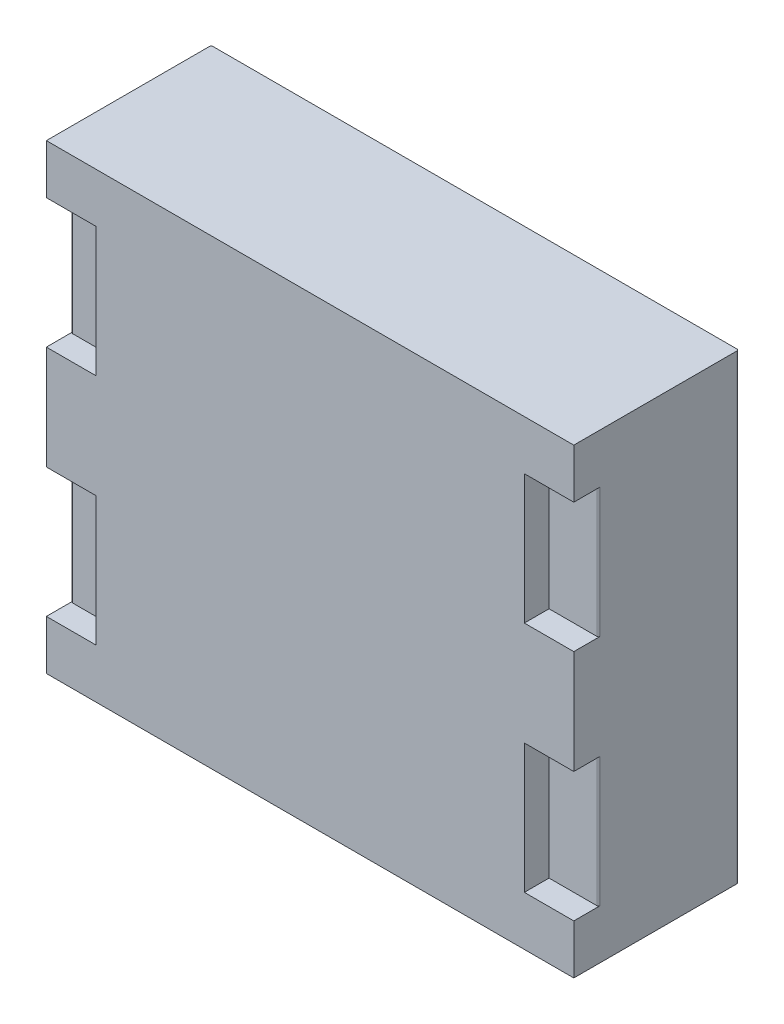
ISO-10303-21;
HEADER;
FILE_DESCRIPTION(('STEP AP214'),'2;1');
FILE_NAME('part.step','',(''),(''),'','','');
FILE_SCHEMA(('AUTOMOTIVE_DESIGN { 1 0 10303 214 1 1 1 1 }'));
ENDSEC;
DATA;
#1=APPLICATION_CONTEXT('core data for automotive mechanical design processes');
#2=APPLICATION_PROTOCOL_DEFINITION('international standard','automotive_design',2000,#1);
#3=PRODUCT_CONTEXT('',#1,'mechanical');
#4=PRODUCT('Part','Part','',(#3));
#5=PRODUCT_RELATED_PRODUCT_CATEGORY('part','',(#4));
#6=PRODUCT_DEFINITION_FORMATION('','',#4);
#7=PRODUCT_DEFINITION_CONTEXT('part definition',#1,'design');
#8=PRODUCT_DEFINITION('design','',#6,#7);
#9=PRODUCT_DEFINITION_SHAPE('','',#8);
#10=(LENGTH_UNIT() NAMED_UNIT(*) SI_UNIT(.MILLI.,.METRE.));
#11=(NAMED_UNIT(*) PLANE_ANGLE_UNIT() SI_UNIT($,.RADIAN.));
#12=(NAMED_UNIT(*) SI_UNIT($,.STERADIAN.) SOLID_ANGLE_UNIT());
#13=UNCERTAINTY_MEASURE_WITH_UNIT(LENGTH_MEASURE(1.E-05),#10,'distance_accuracy_value','');
#14=(GEOMETRIC_REPRESENTATION_CONTEXT(3) GLOBAL_UNCERTAINTY_ASSIGNED_CONTEXT((#13)) GLOBAL_UNIT_ASSIGNED_CONTEXT((#10,
#11,#12)) REPRESENTATION_CONTEXT('',''));
#15=CARTESIAN_POINT('',(0.,0.,0.));
#16=DIRECTION('',(0.,0.,1.));
#17=DIRECTION('',(1.,0.,0.));
#18=AXIS2_PLACEMENT_3D('',#15,#16,#17);
#19=CARTESIAN_POINT('',(-1.3,-0.315,1.));
#20=DIRECTION('',(0.,1.,0.));
#21=DIRECTION('',(1.,0.,0.));
#22=AXIS2_PLACEMENT_3D('',#19,#20,#21);
#23=PLANE('',#22);
#24=DIRECTION('',(0.,0.,-1.));
#25=VECTOR('',#24,1.);
#26=CARTESIAN_POINT('',(-1.6,-0.315,1.));
#27=LINE('',#26,#25);
#28=CARTESIAN_POINT('',(-1.6,-0.315,1.));
#29=VERTEX_POINT('',#28);
#30=CARTESIAN_POINT('',(-1.6,-0.315,0.84));
#31=VERTEX_POINT('',#30);
#32=EDGE_CURVE('E354',#29,#31,#27,.T.);
#33=ORIENTED_EDGE('',*,*,#32,.T.);
#34=CARTESIAN_POINT('',(-1.59,-0.315,0.84));
#35=DIRECTION('',(0.,1.,0.));
#36=DIRECTION('',(0.,0.,1.));
#37=AXIS2_PLACEMENT_3D('',#34,#35,#36);
#38=CIRCLE('',#37,0.01);
#39=CARTESIAN_POINT('',(-1.59,-0.315,0.85));
#40=VERTEX_POINT('',#39);
#41=EDGE_CURVE('E98',#31,#40,#38,.T.);
#42=ORIENTED_EDGE('',*,*,#41,.T.);
#43=DIRECTION('',(-1.,0.,0.));
#44=VECTOR('',#43,1.);
#45=CARTESIAN_POINT('',(-1.3,-0.315,0.85));
#46=LINE('',#45,#44);
#47=CARTESIAN_POINT('',(-1.3,-0.315,0.85));
#48=VERTEX_POINT('',#47);
#49=EDGE_CURVE('E265',#48,#40,#46,.T.);
#50=ORIENTED_EDGE('',*,*,#49,.F.);
#51=DIRECTION('',(0.,0.,-1.));
#52=VECTOR('',#51,1.);
#53=CARTESIAN_POINT('',(-1.3,-0.315,1.));
#54=LINE('',#53,#52);
#55=CARTESIAN_POINT('',(-1.3,-0.315,1.));
#56=VERTEX_POINT('',#55);
#57=EDGE_CURVE('E217',#56,#48,#54,.T.);
#58=ORIENTED_EDGE('',*,*,#57,.F.);
#59=DIRECTION('',(-1.,0.,0.));
#60=VECTOR('',#59,1.);
#61=CARTESIAN_POINT('',(-1.3,-0.315,1.));
#62=LINE('',#61,#60);
#63=EDGE_CURVE('E216',#56,#29,#62,.T.);
#64=ORIENTED_EDGE('',*,*,#63,.T.);
#65=EDGE_LOOP('',(#33,#42,#50,#58,#64));
#66=FACE_BOUND('',#65,.T.);
#67=ADVANCED_FACE('F17',(#66),#23,.F.);
#68=CARTESIAN_POINT('',(1.3,-1.1,0.85));
#69=DIRECTION('',(0.,0.,-1.));
#70=DIRECTION('',(0.,-1.,0.));
#71=AXIS2_PLACEMENT_3D('',#68,#69,#70);
#72=PLANE('',#71);
#73=DIRECTION('',(1.,0.,0.));
#74=VECTOR('',#73,1.);
#75=CARTESIAN_POINT('',(1.3,-1.1,0.85));
#76=LINE('',#75,#74);
#77=CARTESIAN_POINT('',(1.3,-1.1,0.85));
#78=VERTEX_POINT('',#77);
#79=CARTESIAN_POINT('',(1.59,-1.1,0.85));
#80=VERTEX_POINT('',#79);
#81=EDGE_CURVE('E122',#78,#80,#76,.T.);
#82=ORIENTED_EDGE('',*,*,#81,.T.);
#83=DIRECTION('',(0.,1.,0.));
#84=VECTOR('',#83,1.);
#85=CARTESIAN_POINT('',(1.59,-1.1,0.85));
#86=LINE('',#85,#84);
#87=CARTESIAN_POINT('',(1.59,-0.315,0.85));
#88=VERTEX_POINT('',#87);
#89=EDGE_CURVE('E304',#80,#88,#86,.T.);
#90=ORIENTED_EDGE('',*,*,#89,.T.);
#91=DIRECTION('',(1.,0.,0.));
#92=VECTOR('',#91,1.);
#93=CARTESIAN_POINT('',(1.3,-0.315,0.85));
#94=LINE('',#93,#92);
#95=CARTESIAN_POINT('',(1.3,-0.315,0.85));
#96=VERTEX_POINT('',#95);
#97=EDGE_CURVE('E11',#96,#88,#94,.T.);
#98=ORIENTED_EDGE('',*,*,#97,.F.);
#99=DIRECTION('',(0.,1.,0.));
#100=VECTOR('',#99,1.);
#101=CARTESIAN_POINT('',(1.3,-1.1,0.85));
#102=LINE('',#101,#100);
#103=EDGE_CURVE('E45',#78,#96,#102,.T.);
#104=ORIENTED_EDGE('',*,*,#103,.F.);
#105=EDGE_LOOP('',(#82,#90,#98,#104));
#106=FACE_BOUND('',#105,.T.);
#107=ADVANCED_FACE('F408',(#106),#72,.F.);
#108=CARTESIAN_POINT('',(1.3,-0.315,0.85));
#109=DIRECTION('',(0.,1.,0.));
#110=DIRECTION('',(1.,0.,0.));
#111=AXIS2_PLACEMENT_3D('',#108,#109,#110);
#112=PLANE('',#111);
#113=DIRECTION('',(0.,0.,1.));
#114=VECTOR('',#113,1.);
#115=CARTESIAN_POINT('',(1.6,-0.315,0.85));
#116=LINE('',#115,#114);
#117=CARTESIAN_POINT('',(1.6,-0.315,0.84));
#118=VERTEX_POINT('',#117);
#119=CARTESIAN_POINT('',(1.6,-0.315,1.));
#120=VERTEX_POINT('',#119);
#121=EDGE_CURVE('E168',#118,#120,#116,.T.);
#122=ORIENTED_EDGE('',*,*,#121,.T.);
#123=DIRECTION('',(1.,0.,0.));
#124=VECTOR('',#123,1.);
#125=CARTESIAN_POINT('',(1.3,-0.315,1.));
#126=LINE('',#125,#124);
#127=CARTESIAN_POINT('',(1.3,-0.315,1.));
#128=VERTEX_POINT('',#127);
#129=EDGE_CURVE('E110',#128,#120,#126,.T.);
#130=ORIENTED_EDGE('',*,*,#129,.F.);
#131=DIRECTION('',(0.,0.,1.));
#132=VECTOR('',#131,1.);
#133=CARTESIAN_POINT('',(1.3,-0.315,0.85));
#134=LINE('',#133,#132);
#135=EDGE_CURVE('E25',#96,#128,#134,.T.);
#136=ORIENTED_EDGE('',*,*,#135,.F.);
#137=ORIENTED_EDGE('',*,*,#97,.T.);
#138=CARTESIAN_POINT('',(1.59,-0.315,0.84));
#139=DIRECTION('',(0.,1.,0.));
#140=DIRECTION('',(0.,0.,1.));
#141=AXIS2_PLACEMENT_3D('',#138,#139,#140);
#142=CIRCLE('',#141,0.01);
#143=EDGE_CURVE('E371',#88,#118,#142,.T.);
#144=ORIENTED_EDGE('',*,*,#143,.T.);
#145=EDGE_LOOP('',(#122,#130,#136,#137,#144));
#146=FACE_BOUND('',#145,.T.);
#147=ADVANCED_FACE('F418',(#146),#112,.F.);
#148=CARTESIAN_POINT('',(1.3,-1.1,0.85));
#149=DIRECTION('',(1.,0.,0.));
#150=DIRECTION('',(0.,-1.,0.));
#151=AXIS2_PLACEMENT_3D('',#148,#149,#150);
#152=PLANE('',#151);
#153=DIRECTION('',(0.,0.,-1.));
#154=VECTOR('',#153,1.);
#155=CARTESIAN_POINT('',(1.3,-1.1,1.));
#156=LINE('',#155,#154);
#157=CARTESIAN_POINT('',(1.3,-1.1,1.));
#158=VERTEX_POINT('',#157);
#159=EDGE_CURVE('E125',#158,#78,#156,.T.);
#160=ORIENTED_EDGE('',*,*,#159,.T.);
#161=ORIENTED_EDGE('',*,*,#103,.T.);
#162=ORIENTED_EDGE('',*,*,#135,.T.);
#163=DIRECTION('',(0.,-1.,0.));
#164=VECTOR('',#163,1.);
#165=CARTESIAN_POINT('',(1.3,-0.315,1.));
#166=LINE('',#165,#164);
#167=EDGE_CURVE('E162',#128,#158,#166,.T.);
#168=ORIENTED_EDGE('',*,*,#167,.T.);
#169=EDGE_LOOP('',(#160,#161,#162,#168));
#170=FACE_BOUND('',#169,.T.);
#171=ADVANCED_FACE('F400',(#170),#152,.T.);
#172=CARTESIAN_POINT('',(1.3,-1.1,1.));
#173=DIRECTION('',(0.,-1.,0.));
#174=DIRECTION('',(0.,0.,-1.));
#175=AXIS2_PLACEMENT_3D('',#172,#173,#174);
#176=PLANE('',#175);
#177=DIRECTION('',(0.,0.,-1.));
#178=VECTOR('',#177,1.);
#179=CARTESIAN_POINT('',(1.6,-1.1,1.));
#180=LINE('',#179,#178);
#181=CARTESIAN_POINT('',(1.6,-1.1,1.));
#182=VERTEX_POINT('',#181);
#183=CARTESIAN_POINT('',(1.6,-1.1,0.84));
#184=VERTEX_POINT('',#183);
#185=EDGE_CURVE('E167',#182,#184,#180,.T.);
#186=ORIENTED_EDGE('',*,*,#185,.T.);
#187=CARTESIAN_POINT('',(1.59,-1.1,0.84));
#188=DIRECTION('',(0.,-1.,0.));
#189=DIRECTION('',(0.,0.,-1.));
#190=AXIS2_PLACEMENT_3D('',#187,#188,#189);
#191=CIRCLE('',#190,0.01);
#192=EDGE_CURVE('E375',#184,#80,#191,.T.);
#193=ORIENTED_EDGE('',*,*,#192,.T.);
#194=ORIENTED_EDGE('',*,*,#81,.F.);
#195=ORIENTED_EDGE('',*,*,#159,.F.);
#196=DIRECTION('',(1.,0.,0.));
#197=VECTOR('',#196,1.);
#198=CARTESIAN_POINT('',(1.3,-1.1,1.));
#199=LINE('',#198,#197);
#200=EDGE_CURVE('E154',#158,#182,#199,.T.);
#201=ORIENTED_EDGE('',*,*,#200,.T.);
#202=EDGE_LOOP('',(#186,#193,#194,#195,#201));
#203=FACE_BOUND('',#202,.T.);
#204=ADVANCED_FACE('F405',(#203),#176,.F.);
#205=CARTESIAN_POINT('',(-1.3,1.1,0.85));
#206=DIRECTION('',(1.,0.,0.));
#207=DIRECTION('',(0.,1.,0.));
#208=AXIS2_PLACEMENT_3D('',#205,#206,#207);
#209=PLANE('',#208);
#210=DIRECTION('',(0.,1.,0.));
#211=VECTOR('',#210,1.);
#212=CARTESIAN_POINT('',(-1.3,0.315,0.85));
#213=LINE('',#212,#211);
#214=CARTESIAN_POINT('',(-1.3,0.315,0.85));
#215=VERTEX_POINT('',#214);
#216=CARTESIAN_POINT('',(-1.3,1.1,0.85));
#217=VERTEX_POINT('',#216);
#218=EDGE_CURVE('E66',#215,#217,#213,.T.);
#219=ORIENTED_EDGE('',*,*,#218,.F.);
#220=DIRECTION('',(0.,0.,-1.));
#221=VECTOR('',#220,1.);
#222=CARTESIAN_POINT('',(-1.3,0.315,1.));
#223=LINE('',#222,#221);
#224=CARTESIAN_POINT('',(-1.3,0.315,1.));
#225=VERTEX_POINT('',#224);
#226=EDGE_CURVE('E78',#225,#215,#223,.T.);
#227=ORIENTED_EDGE('',*,*,#226,.F.);
#228=DIRECTION('',(0.,-1.,0.));
#229=VECTOR('',#228,1.);
#230=CARTESIAN_POINT('',(-1.3,1.1,1.));
#231=LINE('',#230,#229);
#232=CARTESIAN_POINT('',(-1.3,1.1,1.));
#233=VERTEX_POINT('',#232);
#234=EDGE_CURVE('E86',#233,#225,#231,.T.);
#235=ORIENTED_EDGE('',*,*,#234,.F.);
#236=DIRECTION('',(0.,0.,1.));
#237=VECTOR('',#236,1.);
#238=CARTESIAN_POINT('',(-1.3,1.1,0.85));
#239=LINE('',#238,#237);
#240=EDGE_CURVE('E82',#217,#233,#239,.T.);
#241=ORIENTED_EDGE('',*,*,#240,.F.);
#242=EDGE_LOOP('',(#219,#227,#235,#241));
#243=FACE_BOUND('',#242,.T.);
#244=ADVANCED_FACE('F83',(#243),#209,.F.);
#245=CARTESIAN_POINT('',(-1.3,0.315,1.));
#246=DIRECTION('',(0.,1.,0.));
#247=DIRECTION('',(1.,0.,0.));
#248=AXIS2_PLACEMENT_3D('',#245,#246,#247);
#249=PLANE('',#248);
#250=DIRECTION('',(0.,0.,-1.));
#251=VECTOR('',#250,1.);
#252=CARTESIAN_POINT('',(-1.6,0.315,1.));
#253=LINE('',#252,#251);
#254=CARTESIAN_POINT('',(-1.6,0.315,1.));
#255=VERTEX_POINT('',#254);
#256=CARTESIAN_POINT('',(-1.6,0.315,0.84));
#257=VERTEX_POINT('',#256);
#258=EDGE_CURVE('E350',#255,#257,#253,.T.);
#259=ORIENTED_EDGE('',*,*,#258,.F.);
#260=DIRECTION('',(-1.,0.,0.));
#261=VECTOR('',#260,1.);
#262=CARTESIAN_POINT('',(-1.3,0.315,1.));
#263=LINE('',#262,#261);
#264=EDGE_CURVE('E180',#225,#255,#263,.T.);
#265=ORIENTED_EDGE('',*,*,#264,.F.);
#266=ORIENTED_EDGE('',*,*,#226,.T.);
#267=DIRECTION('',(-1.,0.,0.));
#268=VECTOR('',#267,1.);
#269=CARTESIAN_POINT('',(-1.3,0.315,0.85));
#270=LINE('',#269,#268);
#271=CARTESIAN_POINT('',(-1.59,0.315,0.85));
#272=VERTEX_POINT('',#271);
#273=EDGE_CURVE('E74',#215,#272,#270,.T.);
#274=ORIENTED_EDGE('',*,*,#273,.T.);
#275=CARTESIAN_POINT('',(-1.59,0.315,0.84));
#276=DIRECTION('',(0.,1.,0.));
#277=DIRECTION('',(0.,0.,1.));
#278=AXIS2_PLACEMENT_3D('',#275,#276,#277);
#279=CIRCLE('',#278,0.01);
#280=EDGE_CURVE('E299',#257,#272,#279,.T.);
#281=ORIENTED_EDGE('',*,*,#280,.F.);
#282=EDGE_LOOP('',(#259,#265,#266,#274,#281));
#283=FACE_BOUND('',#282,.T.);
#284=ADVANCED_FACE('F530',(#283),#249,.T.);
#285=CARTESIAN_POINT('',(-1.3,0.315,0.85));
#286=DIRECTION('',(0.,0.,1.));
#287=DIRECTION('',(1.,0.,0.));
#288=AXIS2_PLACEMENT_3D('',#285,#286,#287);
#289=PLANE('',#288);
#290=DIRECTION('',(-1.,0.,0.));
#291=VECTOR('',#290,1.);
#292=CARTESIAN_POINT('',(-1.3,1.1,0.85));
#293=LINE('',#292,#291);
#294=CARTESIAN_POINT('',(-1.59,1.1,0.85));
#295=VERTEX_POINT('',#294);
#296=EDGE_CURVE('E71',#217,#295,#293,.T.);
#297=ORIENTED_EDGE('',*,*,#296,.T.);
#298=DIRECTION('',(0.,1.,0.));
#299=VECTOR('',#298,1.);
#300=CARTESIAN_POINT('',(-1.59,0.315,0.85));
#301=LINE('',#300,#299);
#302=EDGE_CURVE('E303',#272,#295,#301,.T.);
#303=ORIENTED_EDGE('',*,*,#302,.F.);
#304=ORIENTED_EDGE('',*,*,#273,.F.);
#305=ORIENTED_EDGE('',*,*,#218,.T.);
#306=EDGE_LOOP('',(#297,#303,#304,#305));
#307=FACE_BOUND('',#306,.T.);
#308=ADVANCED_FACE('F68',(#307),#289,.T.);
#309=CARTESIAN_POINT('',(-1.3,1.1,0.85));
#310=DIRECTION('',(0.,-1.,0.));
#311=DIRECTION('',(0.,0.,-1.));
#312=AXIS2_PLACEMENT_3D('',#309,#310,#311);
#313=PLANE('',#312);
#314=DIRECTION('',(0.,0.,1.));
#315=VECTOR('',#314,1.);
#316=CARTESIAN_POINT('',(-1.6,1.1,0.85));
#317=LINE('',#316,#315);
#318=CARTESIAN_POINT('',(-1.6,1.1,0.84));
#319=VERTEX_POINT('',#318);
#320=CARTESIAN_POINT('',(-1.6,1.1,1.));
#321=VERTEX_POINT('',#320);
#322=EDGE_CURVE('E261',#319,#321,#317,.T.);
#323=ORIENTED_EDGE('',*,*,#322,.F.);
#324=CARTESIAN_POINT('',(-1.59,1.1,0.84));
#325=DIRECTION('',(0.,-1.,0.));
#326=DIRECTION('',(0.,0.,-1.));
#327=AXIS2_PLACEMENT_3D('',#324,#325,#326);
#328=CIRCLE('',#327,0.01);
#329=EDGE_CURVE('E95',#295,#319,#328,.T.);
#330=ORIENTED_EDGE('',*,*,#329,.F.);
#331=ORIENTED_EDGE('',*,*,#296,.F.);
#332=ORIENTED_EDGE('',*,*,#240,.T.);
#333=DIRECTION('',(-1.,0.,0.));
#334=VECTOR('',#333,1.);
#335=CARTESIAN_POINT('',(-1.3,1.1,1.));
#336=LINE('',#335,#334);
#337=EDGE_CURVE('E181',#233,#321,#336,.T.);
#338=ORIENTED_EDGE('',*,*,#337,.T.);
#339=EDGE_LOOP('',(#323,#330,#331,#332,#338));
#340=FACE_BOUND('',#339,.T.);
#341=ADVANCED_FACE('F93',(#340),#313,.T.);
#342=CARTESIAN_POINT('',(-1.59,1.4,0.01));
#343=DIRECTION('',(0.,1.,0.));
#344=DIRECTION('',(0.,0.,-1.));
#345=AXIS2_PLACEMENT_3D('',#342,#343,#344);
#346=CYLINDRICAL_SURFACE('',#345,0.01);
#347=CARTESIAN_POINT('',(-1.59,1.4,0.01));
#348=DIRECTION('',(0.,-1.,0.));
#349=DIRECTION('',(0.,0.,-1.));
#350=AXIS2_PLACEMENT_3D('',#347,#348,#349);
#351=CIRCLE('',#350,0.01);
#352=CARTESIAN_POINT('',(-1.6,1.4,0.01));
#353=VERTEX_POINT('',#352);
#354=CARTESIAN_POINT('',(-1.59,1.4,0.));
#355=VERTEX_POINT('',#354);
#356=EDGE_CURVE('E199',#353,#355,#351,.T.);
#357=ORIENTED_EDGE('',*,*,#356,.T.);
#358=DIRECTION('',(0.,-1.,0.));
#359=VECTOR('',#358,1.);
#360=CARTESIAN_POINT('',(-1.59,-1.4,0.));
#361=LINE('',#360,#359);
#362=CARTESIAN_POINT('',(-1.59,-1.4,0.));
#363=VERTEX_POINT('',#362);
#364=EDGE_CURVE('E183',#355,#363,#361,.T.);
#365=ORIENTED_EDGE('',*,*,#364,.T.);
#366=CARTESIAN_POINT('',(-1.59,-1.4,0.01));
#367=DIRECTION('',(0.,1.,0.));
#368=DIRECTION('',(0.,0.,1.));
#369=AXIS2_PLACEMENT_3D('',#366,#367,#368);
#370=CIRCLE('',#369,0.01);
#371=CARTESIAN_POINT('',(-1.6,-1.4,0.01));
#372=VERTEX_POINT('',#371);
#373=EDGE_CURVE('E187',#363,#372,#370,.T.);
#374=ORIENTED_EDGE('',*,*,#373,.T.);
#375=DIRECTION('',(0.,-1.,0.));
#376=VECTOR('',#375,1.);
#377=CARTESIAN_POINT('',(-1.6,1.4,0.01));
#378=LINE('',#377,#376);
#379=EDGE_CURVE('E317',#353,#372,#378,.T.);
#380=ORIENTED_EDGE('',*,*,#379,.F.);
#381=EDGE_LOOP('',(#357,#365,#374,#380));
#382=FACE_BOUND('',#381,.T.);
#383=ADVANCED_FACE('F479',(#382),#346,.T.);
#384=CARTESIAN_POINT('',(-1.59,-0.315,0.84));
#385=DIRECTION('',(0.,1.,0.));
#386=DIRECTION('',(0.,0.,-1.));
#387=AXIS2_PLACEMENT_3D('',#384,#385,#386);
#388=CYLINDRICAL_SURFACE('',#387,0.01);
#389=ORIENTED_EDGE('',*,*,#41,.F.);
#390=DIRECTION('',(0.,-1.,0.));
#391=VECTOR('',#390,1.);
#392=CARTESIAN_POINT('',(-1.6,1.4,0.84));
#393=LINE('',#392,#391);
#394=CARTESIAN_POINT('',(-1.6,-1.1,0.84));
#395=VERTEX_POINT('',#394);
#396=EDGE_CURVE('E367',#31,#395,#393,.T.);
#397=ORIENTED_EDGE('',*,*,#396,.T.);
#398=CARTESIAN_POINT('',(-1.59,-1.1,0.84));
#399=DIRECTION('',(0.,-1.,0.));
#400=DIRECTION('',(0.,0.,-1.));
#401=AXIS2_PLACEMENT_3D('',#398,#399,#400);
#402=CIRCLE('',#401,0.01);
#403=CARTESIAN_POINT('',(-1.59,-1.1,0.85));
#404=VERTEX_POINT('',#403);
#405=EDGE_CURVE('E222',#404,#395,#402,.T.);
#406=ORIENTED_EDGE('',*,*,#405,.F.);
#407=DIRECTION('',(0.,-1.,0.));
#408=VECTOR('',#407,1.);
#409=CARTESIAN_POINT('',(-1.59,-0.315,0.85));
#410=LINE('',#409,#408);
#411=EDGE_CURVE('E269',#40,#404,#410,.T.);
#412=ORIENTED_EDGE('',*,*,#411,.F.);
#413=EDGE_LOOP('',(#389,#397,#406,#412));
#414=FACE_BOUND('',#413,.T.);
#415=ADVANCED_FACE('F708',(#414),#388,.T.);
#416=CARTESIAN_POINT('',(-1.59,1.4,0.84));
#417=DIRECTION('',(0.,1.,0.));
#418=DIRECTION('',(0.,0.,-1.));
#419=AXIS2_PLACEMENT_3D('',#416,#417,#418);
#420=CYLINDRICAL_SURFACE('',#419,0.01);
#421=ORIENTED_EDGE('',*,*,#280,.T.);
#422=ORIENTED_EDGE('',*,*,#302,.T.);
#423=ORIENTED_EDGE('',*,*,#329,.T.);
#424=DIRECTION('',(0.,1.,0.));
#425=VECTOR('',#424,1.);
#426=CARTESIAN_POINT('',(-1.6,1.1,0.84));
#427=LINE('',#426,#425);
#428=EDGE_CURVE('E292',#257,#319,#427,.T.);
#429=ORIENTED_EDGE('',*,*,#428,.F.);
#430=EDGE_LOOP('',(#421,#422,#423,#429));
#431=FACE_BOUND('',#430,.T.);
#432=ADVANCED_FACE('F534',(#431),#420,.T.);
#433=CARTESIAN_POINT('',(1.59,-1.1,0.84));
#434=DIRECTION('',(0.,-1.,0.));
#435=DIRECTION('',(0.,0.,1.));
#436=AXIS2_PLACEMENT_3D('',#433,#434,#435);
#437=CYLINDRICAL_SURFACE('',#436,0.01);
#438=ORIENTED_EDGE('',*,*,#192,.F.);
#439=DIRECTION('',(0.,1.,0.));
#440=VECTOR('',#439,1.);
#441=CARTESIAN_POINT('',(1.6,-1.4,0.84));
#442=LINE('',#441,#440);
#443=EDGE_CURVE('E163',#184,#118,#442,.T.);
#444=ORIENTED_EDGE('',*,*,#443,.T.);
#445=ORIENTED_EDGE('',*,*,#143,.F.);
#446=ORIENTED_EDGE('',*,*,#89,.F.);
#447=EDGE_LOOP('',(#438,#444,#445,#446));
#448=FACE_BOUND('',#447,.T.);
#449=ADVANCED_FACE('F412',(#448),#437,.T.);
#450=CARTESIAN_POINT('',(-1.6,-1.4,1.));
#451=DIRECTION('',(0.,1.,0.));
#452=DIRECTION('',(1.,0.,0.));
#453=AXIS2_PLACEMENT_3D('',#450,#451,#452);
#454=PLANE('',#453);
#455=DIRECTION('',(1.,0.,0.));
#456=VECTOR('',#455,1.);
#457=CARTESIAN_POINT('',(-1.6,-1.4,0.));
#458=LINE('',#457,#456);
#459=CARTESIAN_POINT('',(1.59,-1.4,0.));
#460=VERTEX_POINT('',#459);
#461=EDGE_CURVE('E188',#363,#460,#458,.T.);
#462=ORIENTED_EDGE('',*,*,#461,.T.);
#463=CARTESIAN_POINT('',(1.59,-1.4,0.01));
#464=DIRECTION('',(0.,1.,0.));
#465=DIRECTION('',(0.,0.,1.));
#466=AXIS2_PLACEMENT_3D('',#463,#464,#465);
#467=CIRCLE('',#466,0.01);
#468=CARTESIAN_POINT('',(1.6,-1.4,0.01));
#469=VERTEX_POINT('',#468);
#470=EDGE_CURVE('E232',#469,#460,#467,.T.);
#471=ORIENTED_EDGE('',*,*,#470,.F.);
#472=DIRECTION('',(0.,0.,-1.));
#473=VECTOR('',#472,1.);
#474=CARTESIAN_POINT('',(1.6,-1.4,1.));
#475=LINE('',#474,#473);
#476=CARTESIAN_POINT('',(1.6,-1.4,1.));
#477=VERTEX_POINT('',#476);
#478=EDGE_CURVE('E221',#477,#469,#475,.T.);
#479=ORIENTED_EDGE('',*,*,#478,.F.);
#480=DIRECTION('',(1.,0.,0.));
#481=VECTOR('',#480,1.);
#482=CARTESIAN_POINT('',(-1.6,-1.4,1.));
#483=LINE('',#482,#481);
#484=CARTESIAN_POINT('',(-1.6,-1.4,1.));
#485=VERTEX_POINT('',#484);
#486=EDGE_CURVE('E146',#485,#477,#483,.T.);
#487=ORIENTED_EDGE('',*,*,#486,.F.);
#488=DIRECTION('',(0.,0.,-1.));
#489=VECTOR('',#488,1.);
#490=CARTESIAN_POINT('',(-1.6,-1.4,1.));
#491=LINE('',#490,#489);
#492=EDGE_CURVE('E321',#485,#372,#491,.T.);
#493=ORIENTED_EDGE('',*,*,#492,.T.);
#494=ORIENTED_EDGE('',*,*,#373,.F.);
#495=EDGE_LOOP('',(#462,#471,#479,#487,#493,#494));
#496=FACE_BOUND('',#495,.T.);
#497=ADVANCED_FACE('F471',(#496),#454,.F.);
#498=CARTESIAN_POINT('',(-1.6,-1.4,0.));
#499=DIRECTION('',(0.,0.,1.));
#500=DIRECTION('',(1.,0.,0.));
#501=AXIS2_PLACEMENT_3D('',#498,#499,#500);
#502=PLANE('',#501);
#503=DIRECTION('',(-1.,0.,0.));
#504=VECTOR('',#503,1.);
#505=CARTESIAN_POINT('',(1.6,1.4,0.));
#506=LINE('',#505,#504);
#507=CARTESIAN_POINT('',(1.59,1.4,0.));
#508=VERTEX_POINT('',#507);
#509=EDGE_CURVE('E195',#508,#355,#506,.T.);
#510=ORIENTED_EDGE('',*,*,#509,.F.);
#511=DIRECTION('',(0.,1.,0.));
#512=VECTOR('',#511,1.);
#513=CARTESIAN_POINT('',(1.59,-1.4,0.));
#514=LINE('',#513,#512);
#515=EDGE_CURVE('E242',#460,#508,#514,.T.);
#516=ORIENTED_EDGE('',*,*,#515,.F.);
#517=ORIENTED_EDGE('',*,*,#461,.F.);
#518=ORIENTED_EDGE('',*,*,#364,.F.);
#519=EDGE_LOOP('',(#510,#516,#517,#518));
#520=FACE_BOUND('',#519,.T.);
#521=CARTESIAN_POINT('',(0.,0.,0.));
#522=DIRECTION('',(0.,0.,-1.));
#523=DIRECTION('',(1.,0.,0.));
#524=AXIS2_PLACEMENT_3D('',#521,#522,#523);
#525=CIRCLE('',#524,0.4);
#526=CARTESIAN_POINT('',(0.4,0.,0.));
#527=VERTEX_POINT('',#526);
#528=EDGE_CURVE('E132',#527,#527,#525,.T.);
#529=ORIENTED_EDGE('',*,*,#528,.F.);
#530=EDGE_LOOP('',(#529));
#531=FACE_BOUND('',#530,.T.);
#532=ADVANCED_FACE('F483',(#520,#531),#502,.F.);
#533=CARTESIAN_POINT('',(-1.6,1.4,1.));
#534=DIRECTION('',(1.,0.,0.));
#535=DIRECTION('',(0.,1.,0.));
#536=AXIS2_PLACEMENT_3D('',#533,#534,#535);
#537=PLANE('',#536);
#538=DIRECTION('',(0.,0.,-1.));
#539=VECTOR('',#538,1.);
#540=CARTESIAN_POINT('',(-1.6,1.4,1.));
#541=LINE('',#540,#539);
#542=CARTESIAN_POINT('',(-1.6,1.4,1.));
#543=VERTEX_POINT('',#542);
#544=EDGE_CURVE('E335',#543,#353,#541,.T.);
#545=ORIENTED_EDGE('',*,*,#544,.T.);
#546=ORIENTED_EDGE('',*,*,#379,.T.);
#547=ORIENTED_EDGE('',*,*,#492,.F.);
#548=DIRECTION('',(0.,-1.,0.));
#549=VECTOR('',#548,1.);
#550=CARTESIAN_POINT('',(-1.6,1.4,1.));
#551=LINE('',#550,#549);
#552=CARTESIAN_POINT('',(-1.6,-1.1,1.));
#553=VERTEX_POINT('',#552);
#554=EDGE_CURVE('E115',#553,#485,#551,.T.);
#555=ORIENTED_EDGE('',*,*,#554,.F.);
#556=DIRECTION('',(0.,0.,1.));
#557=VECTOR('',#556,1.);
#558=CARTESIAN_POINT('',(-1.6,-1.1,0.85));
#559=LINE('',#558,#557);
#560=EDGE_CURVE('E281',#395,#553,#559,.T.);
#561=ORIENTED_EDGE('',*,*,#560,.F.);
#562=ORIENTED_EDGE('',*,*,#396,.F.);
#563=ORIENTED_EDGE('',*,*,#32,.F.);
#564=DIRECTION('',(0.,-1.,0.));
#565=VECTOR('',#564,1.);
#566=CARTESIAN_POINT('',(-1.6,1.4,1.));
#567=LINE('',#566,#565);
#568=EDGE_CURVE('E212',#255,#29,#567,.T.);
#569=ORIENTED_EDGE('',*,*,#568,.F.);
#570=ORIENTED_EDGE('',*,*,#258,.T.);
#571=ORIENTED_EDGE('',*,*,#428,.T.);
#572=ORIENTED_EDGE('',*,*,#322,.T.);
#573=DIRECTION('',(0.,-1.,0.));
#574=VECTOR('',#573,1.);
#575=CARTESIAN_POINT('',(-1.6,1.4,1.));
#576=LINE('',#575,#574);
#577=EDGE_CURVE('E158',#543,#321,#576,.T.);
#578=ORIENTED_EDGE('',*,*,#577,.F.);
#579=EDGE_LOOP('',(#545,#546,#547,#555,#561,#562,#563,#569,#570,#571,#572,#578));
#580=FACE_BOUND('',#579,.T.);
#581=ADVANCED_FACE('F537',(#580),#537,.F.);
#582=CARTESIAN_POINT('',(0.,0.,0.15));
#583=DIRECTION('',(0.,0.,1.));
#584=DIRECTION('',(-1.,0.,0.));
#585=AXIS2_PLACEMENT_3D('',#582,#583,#584);
#586=CYLINDRICAL_SURFACE('',#585,0.4);
#587=CARTESIAN_POINT('',(0.4,0.,0.));
#588=CARTESIAN_POINT('',(0.4,0.,0.15));
#589=(BOUNDED_CURVE() B_SPLINE_CURVE(1,(#587,#588),.UNSPECIFIED.,.F.,
.F.) B_SPLINE_CURVE_WITH_KNOTS((2,2),(-0.15,0.),
.UNSPECIFIED.) CURVE() GEOMETRIC_REPRESENTATION_ITEM() RATIONAL_B_SPLINE_CURVE((1.,1.)) REPRESENTATION_ITEM(''));
#590=CARTESIAN_POINT('',(0.4,0.,0.15));
#591=VERTEX_POINT('',#590);
#592=EDGE_CURVE('E126',#527,#591,#589,.T.);
#593=ORIENTED_EDGE('',*,*,#592,.F.);
#594=ORIENTED_EDGE('',*,*,#528,.T.);
#595=ORIENTED_EDGE('',*,*,#592,.T.);
#596=CARTESIAN_POINT('',(0.,0.,0.15));
#597=DIRECTION('',(0.,0.,-1.));
#598=DIRECTION('',(1.,0.,0.));
#599=AXIS2_PLACEMENT_3D('',#596,#597,#598);
#600=CIRCLE('',#599,0.4);
#601=EDGE_CURVE('E133',#591,#591,#600,.T.);
#602=ORIENTED_EDGE('',*,*,#601,.F.);
#603=EDGE_LOOP('',(#593,#594,#595,#602));
#604=FACE_BOUND('',#603,.T.);
#605=ADVANCED_FACE('F747',(#604),#586,.F.);
#606=CARTESIAN_POINT('',(0.,0.,0.15));
#607=DIRECTION('',(0.,0.,-1.));
#608=DIRECTION('',(0.,-1.,0.));
#609=AXIS2_PLACEMENT_3D('',#606,#607,#608);
#610=PLANE('',#609);
#611=ORIENTED_EDGE('',*,*,#601,.T.);
#612=EDGE_LOOP('',(#611));
#613=FACE_BOUND('',#612,.T.);
#614=ADVANCED_FACE('F751',(#613),#610,.T.);
#615=CARTESIAN_POINT('',(1.3,1.1,1.));
#616=DIRECTION('',(0.,-1.,0.));
#617=DIRECTION('',(0.,0.,-1.));
#618=AXIS2_PLACEMENT_3D('',#615,#616,#617);
#619=PLANE('',#618);
#620=DIRECTION('',(0.,0.,-1.));
#621=VECTOR('',#620,1.);
#622=CARTESIAN_POINT('',(1.6,1.1,1.));
#623=LINE('',#622,#621);
#624=CARTESIAN_POINT('',(1.6,1.1,1.));
#625=VERTEX_POINT('',#624);
#626=CARTESIAN_POINT('',(1.6,1.1,0.84));
#627=VERTEX_POINT('',#626);
#628=EDGE_CURVE('E233',#625,#627,#623,.T.);
#629=ORIENTED_EDGE('',*,*,#628,.F.);
#630=DIRECTION('',(1.,0.,0.));
#631=VECTOR('',#630,1.);
#632=CARTESIAN_POINT('',(1.3,1.1,1.));
#633=LINE('',#632,#631);
#634=CARTESIAN_POINT('',(1.3,1.1,1.));
#635=VERTEX_POINT('',#634);
#636=EDGE_CURVE('E121',#635,#625,#633,.T.);
#637=ORIENTED_EDGE('',*,*,#636,.F.);
#638=DIRECTION('',(0.,0.,-1.));
#639=VECTOR('',#638,1.);
#640=CARTESIAN_POINT('',(1.3,1.1,1.));
#641=LINE('',#640,#639);
#642=CARTESIAN_POINT('',(1.3,1.1,0.85));
#643=VERTEX_POINT('',#642);
#644=EDGE_CURVE('E331',#635,#643,#641,.T.);
#645=ORIENTED_EDGE('',*,*,#644,.T.);
#646=DIRECTION('',(1.,0.,0.));
#647=VECTOR('',#646,1.);
#648=CARTESIAN_POINT('',(1.3,1.1,0.85));
#649=LINE('',#648,#647);
#650=CARTESIAN_POINT('',(1.59,1.1,0.85));
#651=VERTEX_POINT('',#650);
#652=EDGE_CURVE('E208',#643,#651,#649,.T.);
#653=ORIENTED_EDGE('',*,*,#652,.T.);
#654=CARTESIAN_POINT('',(1.59,1.1,0.84));
#655=DIRECTION('',(0.,-1.,0.));
#656=DIRECTION('',(0.,0.,-1.));
#657=AXIS2_PLACEMENT_3D('',#654,#655,#656);
#658=CIRCLE('',#657,0.01);
#659=EDGE_CURVE('E134',#627,#651,#658,.T.);
#660=ORIENTED_EDGE('',*,*,#659,.F.);
#661=EDGE_LOOP('',(#629,#637,#645,#653,#660));
#662=FACE_BOUND('',#661,.T.);
#663=ADVANCED_FACE('F761',(#662),#619,.T.);
#664=CARTESIAN_POINT('',(1.3,1.1,0.85));
#665=DIRECTION('',(-1.,0.,0.));
#666=DIRECTION('',(0.,0.,1.));
#667=AXIS2_PLACEMENT_3D('',#664,#665,#666);
#668=PLANE('',#667);
#669=ORIENTED_EDGE('',*,*,#644,.F.);
#670=DIRECTION('',(0.,1.,0.));
#671=VECTOR('',#670,1.);
#672=CARTESIAN_POINT('',(1.3,0.315,1.));
#673=LINE('',#672,#671);
#674=CARTESIAN_POINT('',(1.3,0.315,1.));
#675=VERTEX_POINT('',#674);
#676=EDGE_CURVE('E178',#675,#635,#673,.T.);
#677=ORIENTED_EDGE('',*,*,#676,.F.);
#678=DIRECTION('',(0.,0.,1.));
#679=VECTOR('',#678,1.);
#680=CARTESIAN_POINT('',(1.3,0.315,0.85));
#681=LINE('',#680,#679);
#682=CARTESIAN_POINT('',(1.3,0.315,0.85));
#683=VERTEX_POINT('',#682);
#684=EDGE_CURVE('E142',#683,#675,#681,.T.);
#685=ORIENTED_EDGE('',*,*,#684,.F.);
#686=DIRECTION('',(0.,-1.,0.));
#687=VECTOR('',#686,1.);
#688=CARTESIAN_POINT('',(1.3,1.1,0.85));
#689=LINE('',#688,#687);
#690=EDGE_CURVE('E253',#643,#683,#689,.T.);
#691=ORIENTED_EDGE('',*,*,#690,.F.);
#692=EDGE_LOOP('',(#669,#677,#685,#691));
#693=FACE_BOUND('',#692,.T.);
#694=ADVANCED_FACE('F771',(#693),#668,.F.);
#695=CARTESIAN_POINT('',(1.3,1.1,0.85));
#696=DIRECTION('',(0.,0.,1.));
#697=DIRECTION('',(1.,0.,0.));
#698=AXIS2_PLACEMENT_3D('',#695,#696,#697);
#699=PLANE('',#698);
#700=DIRECTION('',(1.,0.,0.));
#701=VECTOR('',#700,1.);
#702=CARTESIAN_POINT('',(1.3,0.315,0.85));
#703=LINE('',#702,#701);
#704=CARTESIAN_POINT('',(1.59,0.315,0.85));
#705=VERTEX_POINT('',#704);
#706=EDGE_CURVE('E343',#683,#705,#703,.T.);
#707=ORIENTED_EDGE('',*,*,#706,.T.);
#708=DIRECTION('',(0.,-1.,0.));
#709=VECTOR('',#708,1.);
#710=CARTESIAN_POINT('',(1.59,1.1,0.85));
#711=LINE('',#710,#709);
#712=EDGE_CURVE('E141',#651,#705,#711,.T.);
#713=ORIENTED_EDGE('',*,*,#712,.F.);
#714=ORIENTED_EDGE('',*,*,#652,.F.);
#715=ORIENTED_EDGE('',*,*,#690,.T.);
#716=EDGE_LOOP('',(#707,#713,#714,#715));
#717=FACE_BOUND('',#716,.T.);
#718=ADVANCED_FACE('F783',(#717),#699,.T.);
#719=CARTESIAN_POINT('',(1.59,-1.4,0.84));
#720=DIRECTION('',(0.,-1.,0.));
#721=DIRECTION('',(0.,0.,1.));
#722=AXIS2_PLACEMENT_3D('',#719,#720,#721);
#723=CYLINDRICAL_SURFACE('',#722,0.01);
#724=ORIENTED_EDGE('',*,*,#659,.T.);
#725=ORIENTED_EDGE('',*,*,#712,.T.);
#726=CARTESIAN_POINT('',(1.59,0.315,0.84));
#727=DIRECTION('',(0.,1.,0.));
#728=DIRECTION('',(0.,0.,1.));
#729=AXIS2_PLACEMENT_3D('',#726,#727,#728);
#730=CIRCLE('',#729,0.01);
#731=CARTESIAN_POINT('',(1.6,0.315,0.84));
#732=VERTEX_POINT('',#731);
#733=EDGE_CURVE('E339',#705,#732,#730,.T.);
#734=ORIENTED_EDGE('',*,*,#733,.T.);
#735=DIRECTION('',(0.,-1.,0.));
#736=VECTOR('',#735,1.);
#737=CARTESIAN_POINT('',(1.6,0.315,0.84));
#738=LINE('',#737,#736);
#739=EDGE_CURVE('E237',#627,#732,#738,.T.);
#740=ORIENTED_EDGE('',*,*,#739,.F.);
#741=EDGE_LOOP('',(#724,#725,#734,#740));
#742=FACE_BOUND('',#741,.T.);
#743=ADVANCED_FACE('F778',(#742),#723,.T.);
#744=CARTESIAN_POINT('',(1.3,0.315,0.85));
#745=DIRECTION('',(0.,1.,0.));
#746=DIRECTION('',(1.,0.,0.));
#747=AXIS2_PLACEMENT_3D('',#744,#745,#746);
#748=PLANE('',#747);
#749=DIRECTION('',(0.,0.,1.));
#750=VECTOR('',#749,1.);
#751=CARTESIAN_POINT('',(1.6,0.315,0.85));
#752=LINE('',#751,#750);
#753=CARTESIAN_POINT('',(1.6,0.315,1.));
#754=VERTEX_POINT('',#753);
#755=EDGE_CURVE('E313',#732,#754,#752,.T.);
#756=ORIENTED_EDGE('',*,*,#755,.F.);
#757=ORIENTED_EDGE('',*,*,#733,.F.);
#758=ORIENTED_EDGE('',*,*,#706,.F.);
#759=ORIENTED_EDGE('',*,*,#684,.T.);
#760=DIRECTION('',(1.,0.,0.));
#761=VECTOR('',#760,1.);
#762=CARTESIAN_POINT('',(1.3,0.315,1.));
#763=LINE('',#762,#761);
#764=EDGE_CURVE('E109',#675,#754,#763,.T.);
#765=ORIENTED_EDGE('',*,*,#764,.T.);
#766=EDGE_LOOP('',(#756,#757,#758,#759,#765));
#767=FACE_BOUND('',#766,.T.);
#768=ADVANCED_FACE('F782',(#767),#748,.T.);
#769=CARTESIAN_POINT('',(1.6,1.4,1.));
#770=DIRECTION('',(0.,-1.,0.));
#771=DIRECTION('',(0.,0.,-1.));
#772=AXIS2_PLACEMENT_3D('',#769,#770,#771);
#773=PLANE('',#772);
#774=DIRECTION('',(0.,0.,-1.));
#775=VECTOR('',#774,1.);
#776=CARTESIAN_POINT('',(1.6,1.4,1.));
#777=LINE('',#776,#775);
#778=CARTESIAN_POINT('',(1.6,1.4,1.));
#779=VERTEX_POINT('',#778);
#780=CARTESIAN_POINT('',(1.6,1.4,0.01));
#781=VERTEX_POINT('',#780);
#782=EDGE_CURVE('E238',#779,#781,#777,.T.);
#783=ORIENTED_EDGE('',*,*,#782,.T.);
#784=CARTESIAN_POINT('',(1.59,1.4,0.01));
#785=DIRECTION('',(0.,-1.,0.));
#786=DIRECTION('',(0.,0.,-1.));
#787=AXIS2_PLACEMENT_3D('',#784,#785,#786);
#788=CIRCLE('',#787,0.01);
#789=EDGE_CURVE('E249',#508,#781,#788,.T.);
#790=ORIENTED_EDGE('',*,*,#789,.F.);
#791=ORIENTED_EDGE('',*,*,#509,.T.);
#792=ORIENTED_EDGE('',*,*,#356,.F.);
#793=ORIENTED_EDGE('',*,*,#544,.F.);
#794=DIRECTION('',(-1.,0.,0.));
#795=VECTOR('',#794,1.);
#796=CARTESIAN_POINT('',(1.6,1.4,1.));
#797=LINE('',#796,#795);
#798=EDGE_CURVE('E120',#779,#543,#797,.T.);
#799=ORIENTED_EDGE('',*,*,#798,.F.);
#800=EDGE_LOOP('',(#783,#790,#791,#792,#793,#799));
#801=FACE_BOUND('',#800,.T.);
#802=ADVANCED_FACE('F802',(#801),#773,.F.);
#803=CARTESIAN_POINT('',(1.6,-1.4,1.));
#804=DIRECTION('',(-1.,0.,0.));
#805=DIRECTION('',(0.,0.,1.));
#806=AXIS2_PLACEMENT_3D('',#803,#804,#805);
#807=PLANE('',#806);
#808=ORIENTED_EDGE('',*,*,#478,.T.);
#809=DIRECTION('',(0.,1.,0.));
#810=VECTOR('',#809,1.);
#811=CARTESIAN_POINT('',(1.6,-1.4,0.01));
#812=LINE('',#811,#810);
#813=EDGE_CURVE('E257',#469,#781,#812,.T.);
#814=ORIENTED_EDGE('',*,*,#813,.T.);
#815=ORIENTED_EDGE('',*,*,#782,.F.);
#816=DIRECTION('',(0.,1.,0.));
#817=VECTOR('',#816,1.);
#818=CARTESIAN_POINT('',(1.6,-1.4,1.));
#819=LINE('',#818,#817);
#820=EDGE_CURVE('E116',#625,#779,#819,.T.);
#821=ORIENTED_EDGE('',*,*,#820,.F.);
#822=ORIENTED_EDGE('',*,*,#628,.T.);
#823=ORIENTED_EDGE('',*,*,#739,.T.);
#824=ORIENTED_EDGE('',*,*,#755,.T.);
#825=DIRECTION('',(0.,1.,0.));
#826=VECTOR('',#825,1.);
#827=CARTESIAN_POINT('',(1.6,-1.4,1.));
#828=LINE('',#827,#826);
#829=EDGE_CURVE('E106',#120,#754,#828,.T.);
#830=ORIENTED_EDGE('',*,*,#829,.F.);
#831=ORIENTED_EDGE('',*,*,#121,.F.);
#832=ORIENTED_EDGE('',*,*,#443,.F.);
#833=ORIENTED_EDGE('',*,*,#185,.F.);
#834=DIRECTION('',(0.,1.,0.));
#835=VECTOR('',#834,1.);
#836=CARTESIAN_POINT('',(1.6,-1.4,1.));
#837=LINE('',#836,#835);
#838=EDGE_CURVE('E150',#477,#182,#837,.T.);
#839=ORIENTED_EDGE('',*,*,#838,.F.);
#840=EDGE_LOOP('',(#808,#814,#815,#821,#822,#823,#824,#830,#831,#832,#833,#839));
#841=FACE_BOUND('',#840,.T.);
#842=ADVANCED_FACE('F812',(#841),#807,.F.);
#843=CARTESIAN_POINT('',(-1.3,-1.1,0.85));
#844=DIRECTION('',(-1.,0.,0.));
#845=DIRECTION('',(0.,1.,0.));
#846=AXIS2_PLACEMENT_3D('',#843,#844,#845);
#847=PLANE('',#846);
#848=DIRECTION('',(0.,-1.,0.));
#849=VECTOR('',#848,1.);
#850=CARTESIAN_POINT('',(-1.3,-0.315,0.85));
#851=LINE('',#850,#849);
#852=CARTESIAN_POINT('',(-1.3,-1.1,0.85));
#853=VERTEX_POINT('',#852);
#854=EDGE_CURVE('E277',#48,#853,#851,.T.);
#855=ORIENTED_EDGE('',*,*,#854,.T.);
#856=DIRECTION('',(0.,0.,1.));
#857=VECTOR('',#856,1.);
#858=CARTESIAN_POINT('',(-1.3,-1.1,0.85));
#859=LINE('',#858,#857);
#860=CARTESIAN_POINT('',(-1.3,-1.1,1.));
#861=VERTEX_POINT('',#860);
#862=EDGE_CURVE('E285',#853,#861,#859,.T.);
#863=ORIENTED_EDGE('',*,*,#862,.T.);
#864=DIRECTION('',(0.,1.,0.));
#865=VECTOR('',#864,1.);
#866=CARTESIAN_POINT('',(-1.3,-1.1,1.));
#867=LINE('',#866,#865);
#868=EDGE_CURVE('E226',#861,#56,#867,.T.);
#869=ORIENTED_EDGE('',*,*,#868,.T.);
#870=ORIENTED_EDGE('',*,*,#57,.T.);
#871=EDGE_LOOP('',(#855,#863,#869,#870));
#872=FACE_BOUND('',#871,.T.);
#873=ADVANCED_FACE('F830',(#872),#847,.T.);
#874=CARTESIAN_POINT('',(-1.3,-1.1,0.85));
#875=DIRECTION('',(0.,-1.,0.));
#876=DIRECTION('',(0.,0.,-1.));
#877=AXIS2_PLACEMENT_3D('',#874,#875,#876);
#878=PLANE('',#877);
#879=ORIENTED_EDGE('',*,*,#560,.T.);
#880=DIRECTION('',(-1.,0.,0.));
#881=VECTOR('',#880,1.);
#882=CARTESIAN_POINT('',(-1.3,-1.1,1.));
#883=LINE('',#882,#881);
#884=EDGE_CURVE('E111',#861,#553,#883,.T.);
#885=ORIENTED_EDGE('',*,*,#884,.F.);
#886=ORIENTED_EDGE('',*,*,#862,.F.);
#887=DIRECTION('',(-1.,0.,0.));
#888=VECTOR('',#887,1.);
#889=CARTESIAN_POINT('',(-1.3,-1.1,0.85));
#890=LINE('',#889,#888);
#891=EDGE_CURVE('E273',#853,#404,#890,.T.);
#892=ORIENTED_EDGE('',*,*,#891,.T.);
#893=ORIENTED_EDGE('',*,*,#405,.T.);
#894=EDGE_LOOP('',(#879,#885,#886,#892,#893));
#895=FACE_BOUND('',#894,.T.);
#896=ADVANCED_FACE('F839',(#895),#878,.F.);
#897=CARTESIAN_POINT('',(-1.3,-0.315,0.85));
#898=DIRECTION('',(0.,0.,-1.));
#899=DIRECTION('',(0.,-1.,0.));
#900=AXIS2_PLACEMENT_3D('',#897,#898,#899);
#901=PLANE('',#900);
#902=ORIENTED_EDGE('',*,*,#49,.T.);
#903=ORIENTED_EDGE('',*,*,#411,.T.);
#904=ORIENTED_EDGE('',*,*,#891,.F.);
#905=ORIENTED_EDGE('',*,*,#854,.F.);
#906=EDGE_LOOP('',(#902,#903,#904,#905));
#907=FACE_BOUND('',#906,.T.);
#908=ADVANCED_FACE('F849',(#907),#901,.F.);
#909=CARTESIAN_POINT('',(1.59,-1.4,0.01));
#910=DIRECTION('',(0.,-1.,0.));
#911=DIRECTION('',(0.,0.,1.));
#912=AXIS2_PLACEMENT_3D('',#909,#910,#911);
#913=CYLINDRICAL_SURFACE('',#912,0.01);
#914=ORIENTED_EDGE('',*,*,#470,.T.);
#915=ORIENTED_EDGE('',*,*,#515,.T.);
#916=ORIENTED_EDGE('',*,*,#789,.T.);
#917=ORIENTED_EDGE('',*,*,#813,.F.);
#918=EDGE_LOOP('',(#914,#915,#916,#917));
#919=FACE_BOUND('',#918,.T.);
#920=ADVANCED_FACE('F492',(#919),#913,.T.);
#921=CARTESIAN_POINT('',(-1.6,-1.4,1.));
#922=DIRECTION('',(0.,0.,1.));
#923=DIRECTION('',(1.,0.,0.));
#924=AXIS2_PLACEMENT_3D('',#921,#922,#923);
#925=PLANE('',#924);
#926=ORIENTED_EDGE('',*,*,#884,.T.);
#927=ORIENTED_EDGE('',*,*,#554,.T.);
#928=ORIENTED_EDGE('',*,*,#486,.T.);
#929=ORIENTED_EDGE('',*,*,#838,.T.);
#930=ORIENTED_EDGE('',*,*,#200,.F.);
#931=ORIENTED_EDGE('',*,*,#167,.F.);
#932=ORIENTED_EDGE('',*,*,#129,.T.);
#933=ORIENTED_EDGE('',*,*,#829,.T.);
#934=ORIENTED_EDGE('',*,*,#764,.F.);
#935=ORIENTED_EDGE('',*,*,#676,.T.);
#936=ORIENTED_EDGE('',*,*,#636,.T.);
#937=ORIENTED_EDGE('',*,*,#820,.T.);
#938=ORIENTED_EDGE('',*,*,#798,.T.);
#939=ORIENTED_EDGE('',*,*,#577,.T.);
#940=ORIENTED_EDGE('',*,*,#337,.F.);
#941=ORIENTED_EDGE('',*,*,#234,.T.);
#942=ORIENTED_EDGE('',*,*,#264,.T.);
#943=ORIENTED_EDGE('',*,*,#568,.T.);
#944=ORIENTED_EDGE('',*,*,#63,.F.);
#945=ORIENTED_EDGE('',*,*,#868,.F.);
#946=EDGE_LOOP('',(#926,#927,#928,#929,#930,#931,#932,#933,#934,#935,#936,#937,#938,#939,#940,
#941,#942,#943,#944,#945));
#947=FACE_BOUND('',#946,.T.);
#948=ADVANCED_FACE('F859',(#947),#925,.T.);
#949=CLOSED_SHELL('',(#67,#107,#147,#171,#204,#244,#284,#308,#341,#383,#415,#432,#449,#497,#532,
#581,#605,#614,#663,#694,#718,#743,#768,#802,#842,#873,#896,#908,#920,#948));
#950=MANIFOLD_SOLID_BREP('B1',#949);
#951=ADVANCED_BREP_SHAPE_REPRESENTATION('',(#18,#950),#14);
#952=SHAPE_DEFINITION_REPRESENTATION(#9,#951);
ENDSEC;
END-ISO-10303-21;
